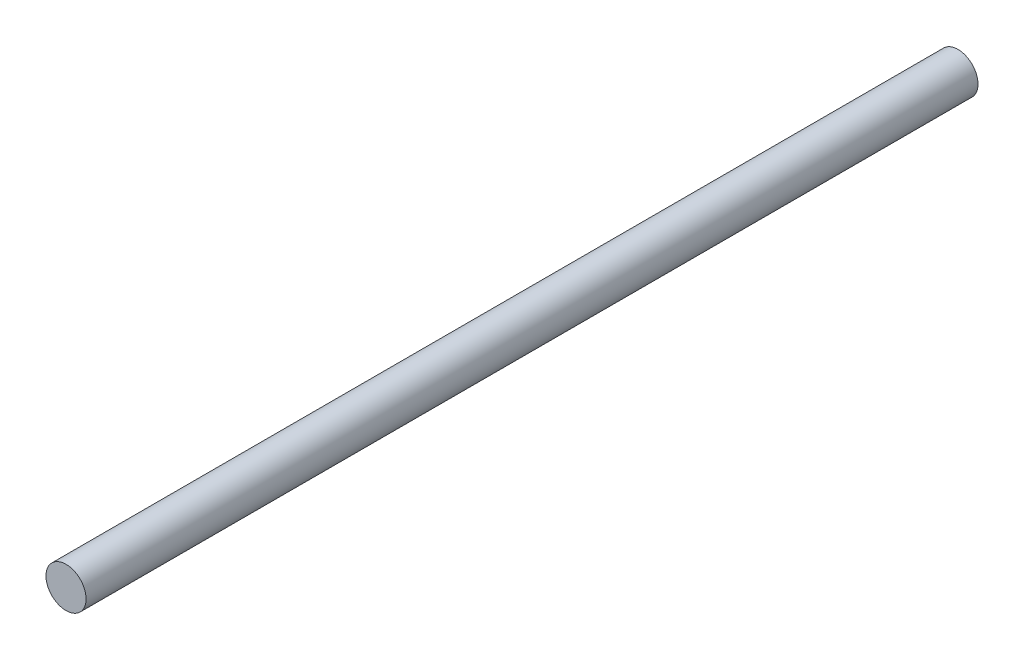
from build123d import *

# Parameters (mm, degrees)
SKETCH1_R           = 3.025
BOSS_EXTRUDE1_DEPTH = 134.45


with BuildPart() as part:
    # Sketch1 → Boss-Extrude1 (new body)
    with BuildSketch(Plane.XY):
        Circle(SKETCH1_R)
    extrude(amount=BOSS_EXTRUDE1_DEPTH)


solid = part.part
